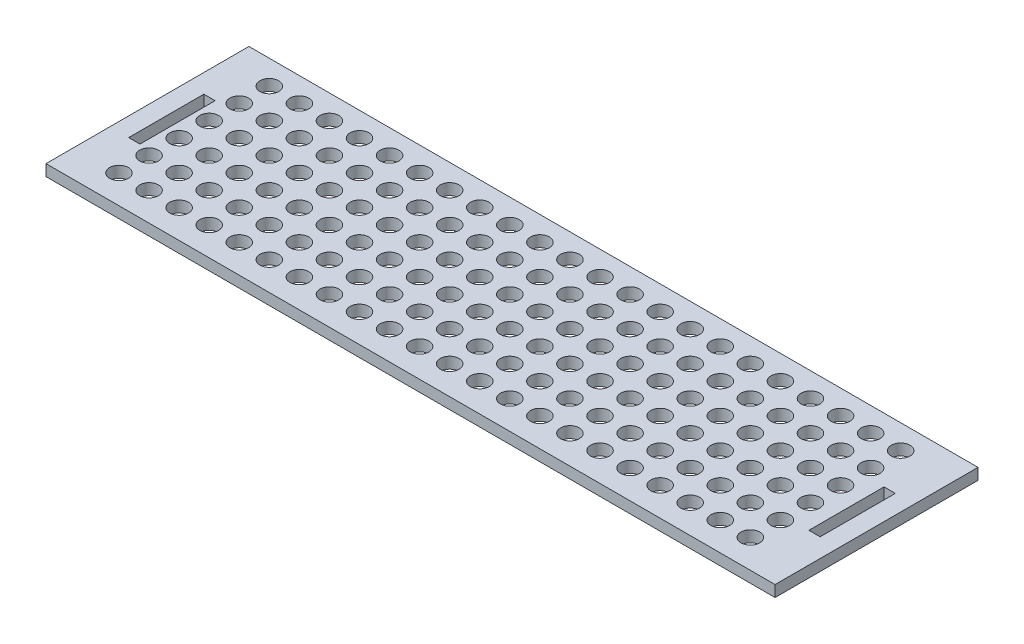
from build123d import *

# Parameters (mm, degrees)
SKETCH1_W           = 194
SKETCH1_H           = 54
SKETCH1_R           = 2.5
SKETCH1_W_2         = 3
SKETCH1_H_2         = 20
BOSS_EXTRUDE1_DEPTH = 3


with BuildPart() as part:
    # Sketch1 → Boss-Extrude1 (new body)
    with BuildSketch(Plane(origin=(0, 0, 0), x_dir=(1, 0, 0), z_dir=(0, 1, 0))):
        with Locations((-41.19706767, -48.044351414)):
            Rectangle(SKETCH1_W, SKETCH1_H)
        with Locations(Location((-126.341630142, -27.478358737, 0), (0, 0, 270))):
            Circle(SKETCH1_R, mode=Mode.SUBTRACT)
        with Locations(Location((-118.341630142, -27.478358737, 0), (0, 0, 270))):
            Circle(SKETCH1_R, mode=Mode.SUBTRACT)
        with Locations(Location((-110.341630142, -27.478358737, 0), (0, 0, 270))):
            Circle(SKETCH1_R, mode=Mode.SUBTRACT)
        with Locations(Location((-102.341630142, -27.478358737, 0), (0, 0, 270))):
            Circle(SKETCH1_R, mode=Mode.SUBTRACT)
        with Locations(Location((-94.341630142, -27.478358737, 0), (0, 0, 270))):
            Circle(SKETCH1_R, mode=Mode.SUBTRACT)
        with Locations(Location((-86.341630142, -27.478358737, 0), (0, 0, 270))):
            Circle(SKETCH1_R, mode=Mode.SUBTRACT)
        with Locations(Location((-78.341630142, -27.478358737, 0), (0, 0, 270))):
            Circle(SKETCH1_R, mode=Mode.SUBTRACT)
        with Locations(Location((-70.341630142, -27.478358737, 0), (0, 0, 270))):
            Circle(SKETCH1_R, mode=Mode.SUBTRACT)
        with Locations(Location((-62.341630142, -27.478358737, 0), (0, 0, 270))):
            Circle(SKETCH1_R, mode=Mode.SUBTRACT)
        with Locations(Location((-54.341630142, -27.478358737, 0), (0, 0, 270))):
            Circle(SKETCH1_R, mode=Mode.SUBTRACT)
        with Locations(Location((-46.341630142, -27.478358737, 0), (0, 0, 270))):
            Circle(SKETCH1_R, mode=Mode.SUBTRACT)
        with Locations(Location((-38.341630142, -27.478358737, 0), (0, 0, 270))):
            Circle(SKETCH1_R, mode=Mode.SUBTRACT)
        with Locations(Location((-30.341630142, -27.478358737, 0), (0, 0, 270))):
            Circle(SKETCH1_R, mode=Mode.SUBTRACT)
        with Locations(Location((-22.341630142, -27.478358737, 0), (0, 0, 270))):
            Circle(SKETCH1_R, mode=Mode.SUBTRACT)
        with Locations(Location((-14.341630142, -27.478358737, 0), (0, 0, 270))):
            Circle(SKETCH1_R, mode=Mode.SUBTRACT)
        with Locations(Location((-6.341630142, -27.478358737, 0), (0, 0, 270))):
            Circle(SKETCH1_R, mode=Mode.SUBTRACT)
        with Locations(Location((1.658369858, -27.478358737, 0), (0, 0, 270))):
            Circle(SKETCH1_R, mode=Mode.SUBTRACT)
        with Locations(Location((9.658369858, -27.478358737, 0), (0, 0, 270))):
            Circle(SKETCH1_R, mode=Mode.SUBTRACT)
        with Locations(Location((17.658369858, -27.478358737, 0), (0, 0, 270))):
            Circle(SKETCH1_R, mode=Mode.SUBTRACT)
        with Locations(Location((25.658369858, -27.478358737, 0), (0, 0, 270))):
            Circle(SKETCH1_R, mode=Mode.SUBTRACT)
        with Locations(Location((33.658369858, -27.478358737, 0), (0, 0, 270))):
            Circle(SKETCH1_R, mode=Mode.SUBTRACT)
        with Locations(Location((41.658369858, -27.478358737, 0), (0, 0, 270))):
            Circle(SKETCH1_R, mode=Mode.SUBTRACT)
        with Locations(Location((-126.341630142, -35.478358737, 0), (0, 0, 270))):
            Circle(SKETCH1_R, mode=Mode.SUBTRACT)
        with Locations(Location((-118.341630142, -35.478358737, 0), (0, 0, 270))):
            Circle(SKETCH1_R, mode=Mode.SUBTRACT)
        with Locations(Location((-110.341630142, -35.478358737, 0), (0, 0, 270))):
            Circle(SKETCH1_R, mode=Mode.SUBTRACT)
        with Locations(Location((-102.341630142, -35.478358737, 0), (0, 0, 270))):
            Circle(SKETCH1_R, mode=Mode.SUBTRACT)
        with Locations(Location((-94.341630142, -35.478358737, 0), (0, 0, 270))):
            Circle(SKETCH1_R, mode=Mode.SUBTRACT)
        with Locations(Location((-86.341630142, -35.478358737, 0), (0, 0, 270))):
            Circle(SKETCH1_R, mode=Mode.SUBTRACT)
        with Locations(Location((-78.341630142, -35.478358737, 0), (0, 0, 270))):
            Circle(SKETCH1_R, mode=Mode.SUBTRACT)
        with Locations(Location((-70.341630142, -35.478358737, 0), (0, 0, 270))):
            Circle(SKETCH1_R, mode=Mode.SUBTRACT)
        with Locations(Location((-62.341630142, -35.478358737, 0), (0, 0, 270))):
            Circle(SKETCH1_R, mode=Mode.SUBTRACT)
        with Locations(Location((-54.341630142, -35.478358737, 0), (0, 0, 270))):
            Circle(SKETCH1_R, mode=Mode.SUBTRACT)
        with Locations(Location((-46.341630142, -35.478358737, 0), (0, 0, 270))):
            Circle(SKETCH1_R, mode=Mode.SUBTRACT)
        with Locations(Location((-38.341630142, -35.478358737, 0), (0, 0, 270))):
            Circle(SKETCH1_R, mode=Mode.SUBTRACT)
        with Locations(Location((-30.341630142, -35.478358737, 0), (0, 0, 270))):
            Circle(SKETCH1_R, mode=Mode.SUBTRACT)
        with Locations(Location((-22.341630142, -35.478358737, 0), (0, 0, 270))):
            Circle(SKETCH1_R, mode=Mode.SUBTRACT)
        with Locations(Location((-14.341630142, -35.478358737, 0), (0, 0, 270))):
            Circle(SKETCH1_R, mode=Mode.SUBTRACT)
        with Locations(Location((-6.341630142, -35.478358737, 0), (0, 0, 270))):
            Circle(SKETCH1_R, mode=Mode.SUBTRACT)
        with Locations(Location((1.658369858, -35.478358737, 0), (0, 0, 270))):
            Circle(SKETCH1_R, mode=Mode.SUBTRACT)
        with Locations(Location((9.658369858, -35.478358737, 0), (0, 0, 270))):
            Circle(SKETCH1_R, mode=Mode.SUBTRACT)
        with Locations(Location((17.658369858, -35.478358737, 0), (0, 0, 270))):
            Circle(SKETCH1_R, mode=Mode.SUBTRACT)
        with Locations(Location((25.658369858, -35.478358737, 0), (0, 0, 270))):
            Circle(SKETCH1_R, mode=Mode.SUBTRACT)
        with Locations(Location((33.658369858, -35.478358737, 0), (0, 0, 270))):
            Circle(SKETCH1_R, mode=Mode.SUBTRACT)
        with Locations(Location((41.658369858, -35.478358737, 0), (0, 0, 270))):
            Circle(SKETCH1_R, mode=Mode.SUBTRACT)
        with Locations(Location((-126.341630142, -43.478358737, 0), (0, 0, 270))):
            Circle(SKETCH1_R, mode=Mode.SUBTRACT)
        with Locations(Location((-118.341630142, -43.478358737, 0), (0, 0, 270))):
            Circle(SKETCH1_R, mode=Mode.SUBTRACT)
        with Locations(Location((-110.341630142, -43.478358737, 0), (0, 0, 270))):
            Circle(SKETCH1_R, mode=Mode.SUBTRACT)
        with Locations(Location((-102.341630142, -43.478358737, 0), (0, 0, 270))):
            Circle(SKETCH1_R, mode=Mode.SUBTRACT)
        with Locations(Location((-94.341630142, -43.478358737, 0), (0, 0, 270))):
            Circle(SKETCH1_R, mode=Mode.SUBTRACT)
        with Locations(Location((-86.341630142, -43.478358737, 0), (0, 0, 270))):
            Circle(SKETCH1_R, mode=Mode.SUBTRACT)
        with Locations(Location((-78.341630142, -43.478358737, 0), (0, 0, 270))):
            Circle(SKETCH1_R, mode=Mode.SUBTRACT)
        with Locations(Location((-70.341630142, -43.478358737, 0), (0, 0, 270))):
            Circle(SKETCH1_R, mode=Mode.SUBTRACT)
        with Locations(Location((-62.341630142, -43.478358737, 0), (0, 0, 270))):
            Circle(SKETCH1_R, mode=Mode.SUBTRACT)
        with Locations(Location((-54.341630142, -43.478358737, 0), (0, 0, 270))):
            Circle(SKETCH1_R, mode=Mode.SUBTRACT)
        with Locations(Location((-46.341630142, -43.478358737, 0), (0, 0, 270))):
            Circle(SKETCH1_R, mode=Mode.SUBTRACT)
        with Locations(Location((-38.341630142, -43.478358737, 0), (0, 0, 270))):
            Circle(SKETCH1_R, mode=Mode.SUBTRACT)
        with Locations(Location((-30.341630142, -43.478358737, 0), (0, 0, 270))):
            Circle(SKETCH1_R, mode=Mode.SUBTRACT)
        with Locations(Location((-22.341630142, -43.478358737, 0), (0, 0, 270))):
            Circle(SKETCH1_R, mode=Mode.SUBTRACT)
        with Locations(Location((-14.341630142, -43.478358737, 0), (0, 0, 270))):
            Circle(SKETCH1_R, mode=Mode.SUBTRACT)
        with Locations(Location((-6.341630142, -43.478358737, 0), (0, 0, 270))):
            Circle(SKETCH1_R, mode=Mode.SUBTRACT)
        with Locations(Location((1.658369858, -43.478358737, 0), (0, 0, 270))):
            Circle(SKETCH1_R, mode=Mode.SUBTRACT)
        with Locations(Location((9.658369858, -43.478358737, 0), (0, 0, 270))):
            Circle(SKETCH1_R, mode=Mode.SUBTRACT)
        with Locations(Location((17.658369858, -43.478358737, 0), (0, 0, 270))):
            Circle(SKETCH1_R, mode=Mode.SUBTRACT)
        with Locations(Location((25.658369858, -43.478358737, 0), (0, 0, 270))):
            Circle(SKETCH1_R, mode=Mode.SUBTRACT)
        with Locations(Location((33.658369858, -43.478358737, 0), (0, 0, 270))):
            Circle(SKETCH1_R, mode=Mode.SUBTRACT)
        with Locations(Location((41.658369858, -43.478358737, 0), (0, 0, 270))):
            Circle(SKETCH1_R, mode=Mode.SUBTRACT)
        with Locations(Location((-126.341630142, -51.478358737, 0), (0, 0, 270))):
            Circle(SKETCH1_R, mode=Mode.SUBTRACT)
        with Locations(Location((-118.341630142, -51.478358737, 0), (0, 0, 270))):
            Circle(SKETCH1_R, mode=Mode.SUBTRACT)
        with Locations(Location((-110.341630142, -51.478358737, 0), (0, 0, 270))):
            Circle(SKETCH1_R, mode=Mode.SUBTRACT)
        with Locations(Location((-102.341630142, -51.478358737, 0), (0, 0, 270))):
            Circle(SKETCH1_R, mode=Mode.SUBTRACT)
        with Locations(Location((-94.341630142, -51.478358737, 0), (0, 0, 270))):
            Circle(SKETCH1_R, mode=Mode.SUBTRACT)
        with Locations(Location((-86.341630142, -51.478358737, 0), (0, 0, 270))):
            Circle(SKETCH1_R, mode=Mode.SUBTRACT)
        with Locations(Location((-78.341630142, -51.478358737, 0), (0, 0, 270))):
            Circle(SKETCH1_R, mode=Mode.SUBTRACT)
        with Locations(Location((-70.341630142, -51.478358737, 0), (0, 0, 270))):
            Circle(SKETCH1_R, mode=Mode.SUBTRACT)
        with Locations(Location((-62.341630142, -51.478358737, 0), (0, 0, 270))):
            Circle(SKETCH1_R, mode=Mode.SUBTRACT)
        with Locations(Location((-54.341630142, -51.478358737, 0), (0, 0, 270))):
            Circle(SKETCH1_R, mode=Mode.SUBTRACT)
        with Locations(Location((-46.341630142, -51.478358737, 0), (0, 0, 270))):
            Circle(SKETCH1_R, mode=Mode.SUBTRACT)
        with Locations(Location((-38.341630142, -51.478358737, 0), (0, 0, 270))):
            Circle(SKETCH1_R, mode=Mode.SUBTRACT)
        with Locations(Location((-30.341630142, -51.478358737, 0), (0, 0, 270))):
            Circle(SKETCH1_R, mode=Mode.SUBTRACT)
        with Locations(Location((-22.341630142, -51.478358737, 0), (0, 0, 270))):
            Circle(SKETCH1_R, mode=Mode.SUBTRACT)
        with Locations(Location((-14.341630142, -51.478358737, 0), (0, 0, 270))):
            Circle(SKETCH1_R, mode=Mode.SUBTRACT)
        with Locations(Location((-6.341630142, -51.478358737, 0), (0, 0, 270))):
            Circle(SKETCH1_R, mode=Mode.SUBTRACT)
        with Locations(Location((1.658369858, -51.478358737, 0), (0, 0, 270))):
            Circle(SKETCH1_R, mode=Mode.SUBTRACT)
        with Locations(Location((9.658369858, -51.478358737, 0), (0, 0, 270))):
            Circle(SKETCH1_R, mode=Mode.SUBTRACT)
        with Locations(Location((17.658369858, -51.478358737, 0), (0, 0, 270))):
            Circle(SKETCH1_R, mode=Mode.SUBTRACT)
        with Locations(Location((25.658369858, -51.478358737, 0), (0, 0, 270))):
            Circle(SKETCH1_R, mode=Mode.SUBTRACT)
        with Locations(Location((33.658369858, -51.478358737, 0), (0, 0, 270))):
            Circle(SKETCH1_R, mode=Mode.SUBTRACT)
        with Locations(Location((41.658369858, -51.478358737, 0), (0, 0, 270))):
            Circle(SKETCH1_R, mode=Mode.SUBTRACT)
        with Locations(Location((-126.341630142, -59.478358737, 0), (0, 0, 270))):
            Circle(SKETCH1_R, mode=Mode.SUBTRACT)
        with Locations(Location((-118.341630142, -59.478358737, 0), (0, 0, 270))):
            Circle(SKETCH1_R, mode=Mode.SUBTRACT)
        with Locations(Location((-110.341630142, -59.478358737, 0), (0, 0, 270))):
            Circle(SKETCH1_R, mode=Mode.SUBTRACT)
        with Locations(Location((-102.341630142, -59.478358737, 0), (0, 0, 270))):
            Circle(SKETCH1_R, mode=Mode.SUBTRACT)
        with Locations(Location((-94.341630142, -59.478358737, 0), (0, 0, 270))):
            Circle(SKETCH1_R, mode=Mode.SUBTRACT)
        with Locations(Location((-86.341630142, -59.478358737, 0), (0, 0, 270))):
            Circle(SKETCH1_R, mode=Mode.SUBTRACT)
        with Locations(Location((-78.341630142, -59.478358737, 0), (0, 0, 270))):
            Circle(SKETCH1_R, mode=Mode.SUBTRACT)
        with Locations(Location((-70.341630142, -59.478358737, 0), (0, 0, 270))):
            Circle(SKETCH1_R, mode=Mode.SUBTRACT)
        with Locations(Location((-62.341630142, -59.478358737, 0), (0, 0, 270))):
            Circle(SKETCH1_R, mode=Mode.SUBTRACT)
        with Locations(Location((-54.341630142, -59.478358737, 0), (0, 0, 270))):
            Circle(SKETCH1_R, mode=Mode.SUBTRACT)
        with Locations(Location((-46.341630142, -59.478358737, 0), (0, 0, 270))):
            Circle(SKETCH1_R, mode=Mode.SUBTRACT)
        with Locations(Location((-38.341630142, -59.478358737, 0), (0, 0, 270))):
            Circle(SKETCH1_R, mode=Mode.SUBTRACT)
        with Locations(Location((-30.341630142, -59.478358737, 0), (0, 0, 270))):
            Circle(SKETCH1_R, mode=Mode.SUBTRACT)
        with Locations(Location((-22.341630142, -59.478358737, 0), (0, 0, 270))):
            Circle(SKETCH1_R, mode=Mode.SUBTRACT)
        with Locations(Location((-14.341630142, -59.478358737, 0), (0, 0, 270))):
            Circle(SKETCH1_R, mode=Mode.SUBTRACT)
        with Locations(Location((-6.341630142, -59.478358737, 0), (0, 0, 270))):
            Circle(SKETCH1_R, mode=Mode.SUBTRACT)
        with Locations(Location((1.658369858, -59.478358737, 0), (0, 0, 270))):
            Circle(SKETCH1_R, mode=Mode.SUBTRACT)
        with Locations(Location((9.658369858, -59.478358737, 0), (0, 0, 270))):
            Circle(SKETCH1_R, mode=Mode.SUBTRACT)
        with Locations(Location((17.658369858, -59.478358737, 0), (0, 0, 270))):
            Circle(SKETCH1_R, mode=Mode.SUBTRACT)
        with Locations(Location((25.658369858, -59.478358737, 0), (0, 0, 270))):
            Circle(SKETCH1_R, mode=Mode.SUBTRACT)
        with Locations(Location((33.658369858, -59.478358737, 0), (0, 0, 270))):
            Circle(SKETCH1_R, mode=Mode.SUBTRACT)
        with Locations(Location((41.658369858, -59.478358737, 0), (0, 0, 270))):
            Circle(SKETCH1_R, mode=Mode.SUBTRACT)
        with Locations(Location((-126.341630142, -67.478358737, 0), (0, 0, 270))):
            Circle(SKETCH1_R, mode=Mode.SUBTRACT)
        with Locations(Location((-118.341630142, -67.478358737, 0), (0, 0, 270))):
            Circle(SKETCH1_R, mode=Mode.SUBTRACT)
        with Locations(Location((-110.341630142, -67.478358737, 0), (0, 0, 270))):
            Circle(SKETCH1_R, mode=Mode.SUBTRACT)
        with Locations(Location((-102.341630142, -67.478358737, 0), (0, 0, 270))):
            Circle(SKETCH1_R, mode=Mode.SUBTRACT)
        with Locations(Location((-94.341630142, -67.478358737, 0), (0, 0, 270))):
            Circle(SKETCH1_R, mode=Mode.SUBTRACT)
        with Locations(Location((-86.341630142, -67.478358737, 0), (0, 0, 270))):
            Circle(SKETCH1_R, mode=Mode.SUBTRACT)
        with Locations(Location((-78.341630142, -67.478358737, 0), (0, 0, 270))):
            Circle(SKETCH1_R, mode=Mode.SUBTRACT)
        with Locations(Location((-70.341630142, -67.478358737, 0), (0, 0, 270))):
            Circle(SKETCH1_R, mode=Mode.SUBTRACT)
        with Locations(Location((-62.341630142, -67.478358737, 0), (0, 0, 270))):
            Circle(SKETCH1_R, mode=Mode.SUBTRACT)
        with Locations(Location((-54.341630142, -67.478358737, 0), (0, 0, 270))):
            Circle(SKETCH1_R, mode=Mode.SUBTRACT)
        with Locations(Location((-46.341630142, -67.478358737, 0), (0, 0, 270))):
            Circle(SKETCH1_R, mode=Mode.SUBTRACT)
        with Locations(Location((-38.341630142, -67.478358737, 0), (0, 0, 270))):
            Circle(SKETCH1_R, mode=Mode.SUBTRACT)
        with Locations(Location((-30.341630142, -67.478358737, 0), (0, 0, 270))):
            Circle(SKETCH1_R, mode=Mode.SUBTRACT)
        with Locations(Location((-22.341630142, -67.478358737, 0), (0, 0, 270))):
            Circle(SKETCH1_R, mode=Mode.SUBTRACT)
        with Locations(Location((-14.341630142, -67.478358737, 0), (0, 0, 270))):
            Circle(SKETCH1_R, mode=Mode.SUBTRACT)
        with Locations(Location((-6.341630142, -67.478358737, 0), (0, 0, 270))):
            Circle(SKETCH1_R, mode=Mode.SUBTRACT)
        with Locations(Location((1.658369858, -67.478358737, 0), (0, 0, 270))):
            Circle(SKETCH1_R, mode=Mode.SUBTRACT)
        with Locations(Location((9.658369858, -67.478358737, 0), (0, 0, 270))):
            Circle(SKETCH1_R, mode=Mode.SUBTRACT)
        with Locations(Location((17.658369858, -67.478358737, 0), (0, 0, 270))):
            Circle(SKETCH1_R, mode=Mode.SUBTRACT)
        with Locations(Location((25.658369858, -67.478358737, 0), (0, 0, 270))):
            Circle(SKETCH1_R, mode=Mode.SUBTRACT)
        with Locations(Location((33.658369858, -67.478358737, 0), (0, 0, 270))):
            Circle(SKETCH1_R, mode=Mode.SUBTRACT)
        with Locations(Location((41.658369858, -67.478358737, 0), (0, 0, 270))):
            Circle(SKETCH1_R, mode=Mode.SUBTRACT)
        with Locations((49.30293233, -48.044351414)):
            Rectangle(SKETCH1_W_2, SKETCH1_H_2, mode=Mode.SUBTRACT)
        with Locations((-131.69706767, -48.044351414)):
            Rectangle(SKETCH1_W_2, SKETCH1_H_2, mode=Mode.SUBTRACT)
    extrude(amount=BOSS_EXTRUDE1_DEPTH)


solid = part.part
